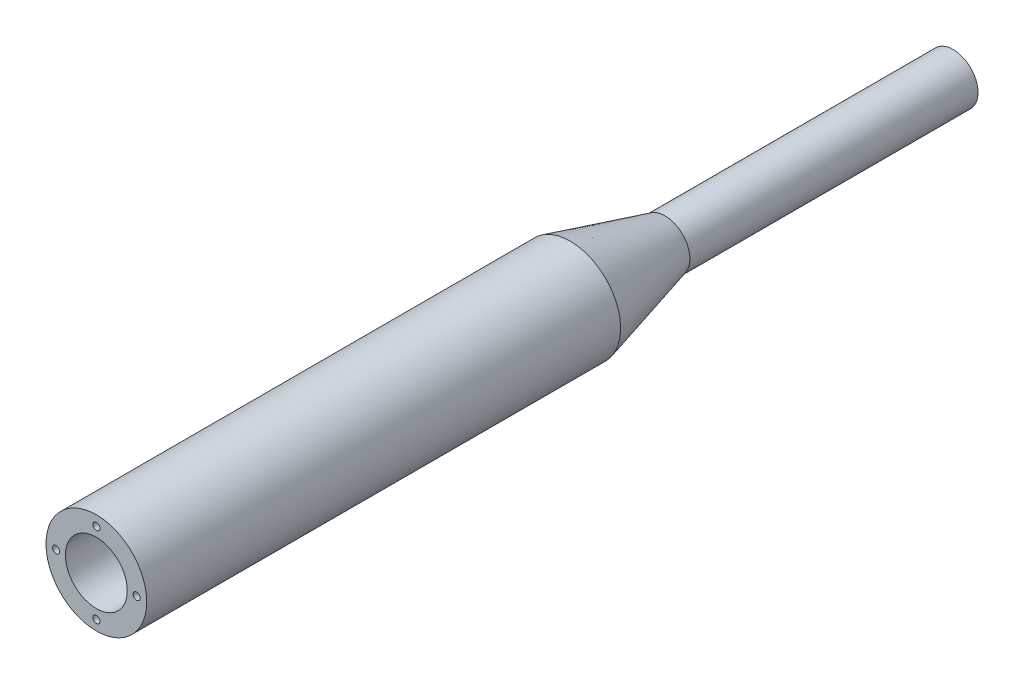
from build123d import *

# Parameters (mm, degrees)
SKETCH1_R                  = 26.9875
BOSS_EXTRUDE1_DEPTH        = 254
SKETCH2_R                  = 13.335
SKETCH2_R_2                = 6.35
BOSS_EXTRUDE2_DEPTH        = 205.232
F_1_1_DIAMETER_HOLE1_D     = 31.75
F_1_1_DIAMETER_HOLE1_DEPTH = 254
F_1_1_DIAMETER_HOLE1_TIP   = 9.538662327
SKETCH8_R                  = 16.5735
CUT_EXTRUDE1_DEPTH         = 25.4
F_10_24_TAPPED_HOLE1_D     = 3.7973
F_10_24_TAPPED_HOLE1_DEPTH = 25.4
F_10_24_TAPPED_HOLE1_TIP   = 1.140824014


with BuildPart() as part:
    # Sketch1 → Boss-Extrude1 (new body)
    with BuildSketch(Plane.XY):
        Circle(SKETCH1_R)
    extrude(amount=BOSS_EXTRUDE1_DEPTH)



with BuildPart() as body_2:
    # Sketch2 → Boss-Extrude2 (new body)
    with BuildSketch(Plane(origin=(0, 0, 0), x_dir=(-1, 0, 0), z_dir=(0, 0, -1))):
        Circle(SKETCH2_R)
        Circle(SKETCH2_R_2, mode=Mode.SUBTRACT)
    extrude(amount=BOSS_EXTRUDE2_DEPTH)


with BuildPart() as part_1:
    add(part.part)

    add(body_2.part)  # Revolve1 merges body 2
    # Sketch4 → Revolve1 (revolve)
    with BuildSketch(Plane(origin=(0, 0, 0), x_dir=(0, 0, -1), z_dir=(1, 0, 0)), mode=Mode.PRIVATE) as revolve1_sk:
        Polygon((0, 26.9875), (0, 13.335), (50.8, 13.335), align=None)
    revolve(revolve1_sk.sketch.rotate(Axis((0, 0, -205.232), (0, 0, 1)), 90), axis=Axis((0, 0, -205.232), (0, 0, 1)))

    # 1 _1_ Diameter Hole1
    with Locations(Plane.XY.offset(254)):
        with Locations((0, 0)):
            Hole(F_1_1_DIAMETER_HOLE1_D / 2, depth=F_1_1_DIAMETER_HOLE1_DEPTH)
            with Locations((0, 0, -(F_1_1_DIAMETER_HOLE1_DEPTH + F_1_1_DIAMETER_HOLE1_TIP / 2))):  # 118° drill point
                Cone(0, F_1_1_DIAMETER_HOLE1_D / 2, F_1_1_DIAMETER_HOLE1_TIP, mode=Mode.SUBTRACT)

    # Sketch8 → Cut-Extrude1 (cut)
    with BuildSketch(Plane.XY.offset(254)):
        Circle(SKETCH8_R)
    extrude(amount=-CUT_EXTRUDE1_DEPTH, mode=Mode.SUBTRACT)

    # 10-24 Tapped Hole1
    with Locations(Plane.XY.offset(254)):
        with Locations((0, 21.59), (-21.59, 0), (0, -21.59), (21.59, 0)):
            Hole(F_10_24_TAPPED_HOLE1_D / 2, depth=F_10_24_TAPPED_HOLE1_DEPTH)
            with Locations((0, 0, -(F_10_24_TAPPED_HOLE1_DEPTH + F_10_24_TAPPED_HOLE1_TIP / 2))):  # 118° drill point
                Cone(0, F_10_24_TAPPED_HOLE1_D / 2, F_10_24_TAPPED_HOLE1_TIP, mode=Mode.SUBTRACT)


solid = part_1.part
